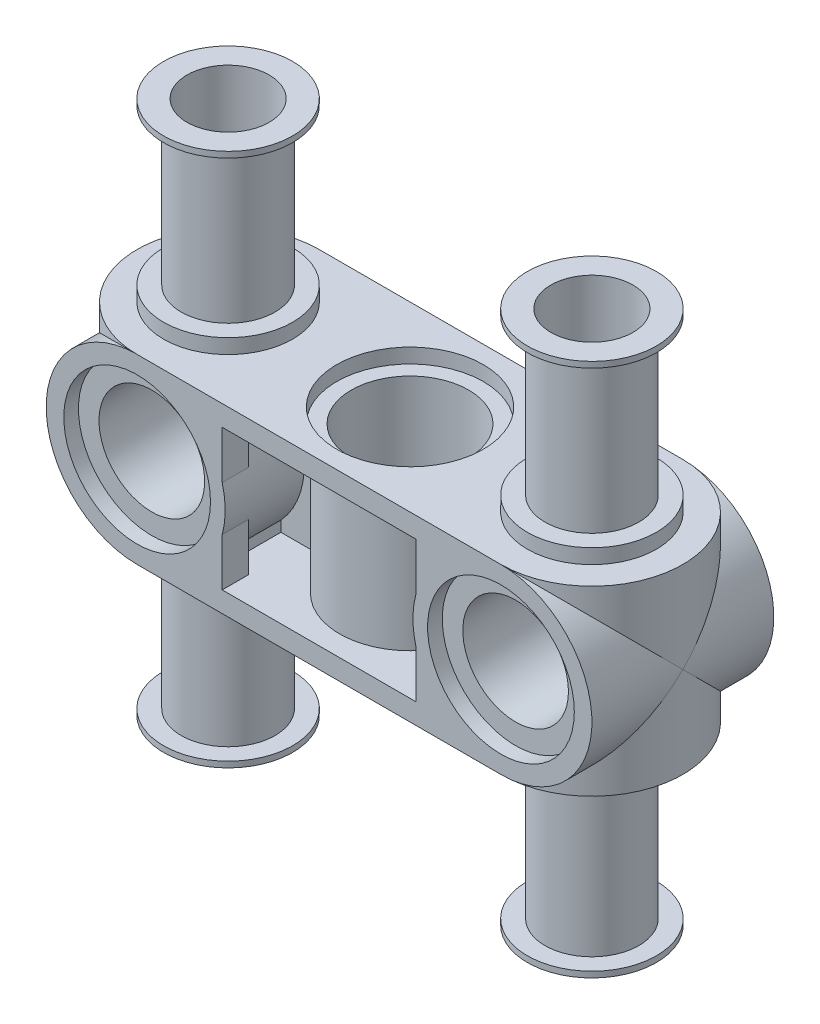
from build123d import *
from build123d.topology import SkipClean

# Parameters (mm, degrees)
EXTRUDE1_DEPTH     = 3.937
SKETCH2_R          = 2.794
CUT_EXTRUDE1_DEPTH = 0.254
SKETCH3_R          = 2.794
EXTRUDE2_DEPTH     = 0.635
SKETCH5_R          = 2.032
SKETCH5_R_2        = 1.778
EXTRUDE4_DEPTH     = 6.985
EXTRUDE5_START     = -0.254
SKETCH6_R          = 2.794
SKETCH6_R_2        = 1.778
EXTRUDE5_DEPTH     = 0.254
EXTRUDE6_DEPTH     = 7.874
SKETCH8_R          = 2.54
CUT_EXTRUDE2_DEPTH = 3.556
SKETCH9_R          = 2.286
CUT_EXTRUDE3_DEPTH = 17.110989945
SKETCH10_R         = 3.175
CUT_EXTRUDE4_DEPTH = 0.635
CUT_EXTRUDE6_DEPTH = 3.048
SKETCH13_R         = 2.54
CUT_EXTRUDE7_DEPTH = 15.799178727
SKETCH14_R         = 3.175
CUT_EXTRUDE8_DEPTH = 0.635
EXTRUDE8_DEPTH     = 7.112


with BuildPart() as part:
    # Sketch1 → Extrude1 (new body)
    with BuildSketch(Plane(origin=(0, 0, 0), x_dir=(1, 0, 0), z_dir=(0, 1, 0))):
        with BuildLine():
            Line((-7.874, 3.937), (7.874, 3.937))
            ThreePointArc((7.874, 3.937), (11.811, 0), (7.874, -3.937))
            Line((7.874, -3.937), (-7.874, -3.937))
            ThreePointArc((-7.874, -3.937), (-11.811, 0), (-7.874, 3.937))
        make_face()
    extrude(amount=EXTRUDE1_DEPTH)

    # Sketch2 → Cut-Extrude1 (cut)
    with BuildSketch(Plane.XZ):
        with Locations(Location((0, 0, 0), (0, 0, 270))):
            Circle(SKETCH2_R)
    extrude(amount=-CUT_EXTRUDE1_DEPTH, mode=Mode.SUBTRACT)

    # Sketch3 → Extrude2 (add)
    with BuildSketch(Plane.XZ):
        with Locations(Location((7.874, 0, 0), (0, 0, 90))):
            Circle(SKETCH3_R)
        with Locations(Location((-7.874, 0, 0), (0, 0, 90))):
            Circle(SKETCH3_R)
    extrude(amount=EXTRUDE2_DEPTH)

    # Sketch5 → Extrude4 (add)
    # profile 1 of 2: a face of its own
    with BuildSketch(Plane.XZ.offset(0.635)):
        with Locations(Location((7.874, 0, 0), (0, 0, 270))):
            Circle(SKETCH5_R)
        with Locations(Location((7.874, 0, 0), (0, 0, 270))):
            Circle(SKETCH5_R_2, mode=Mode.SUBTRACT)
    # profile 2 of 2: a face of its own
    with BuildSketch(Plane.XZ.offset(0.635)):
        with Locations(Location((-7.874, 0, 0), (0, 0, 270))):
            Circle(SKETCH5_R)
        with Locations(Location((-7.874, 0, 0), (0, 0, 270))):
            Circle(SKETCH5_R_2, mode=Mode.SUBTRACT)
    extrude(amount=EXTRUDE4_DEPTH)

    # Sketch6 → Extrude5 (add)
    # profile 1 of 2: a face of its own
    with BuildSketch(Plane.XZ.offset(7.62).offset(EXTRUDE5_START)):
        with Locations(Location((-7.874, 0, 0), (0, 0, 90))):
            Circle(SKETCH6_R)
        with Locations(Location((-7.874, 0, 0), (0, 0, 270))):
            Circle(SKETCH6_R_2, mode=Mode.SUBTRACT)
    # profile 2 of 2: a face of its own
    with BuildSketch(Plane.XZ.offset(7.62).offset(EXTRUDE5_START)):
        with Locations(Location((7.874, 0, 0), (0, 0, 90))):
            Circle(SKETCH6_R)
        with Locations(Location((7.874, 0, 0), (0, 0, 270))):
            Circle(SKETCH6_R_2, mode=Mode.SUBTRACT)
    extrude(amount=EXTRUDE5_DEPTH)

    # Sketch7 → Extrude6 (add)
    with BuildSketch(Plane(origin=(0, 0, -3.937), x_dir=(-1, 0, 0), z_dir=(0, 0, -1))):
        with BuildLine():
            Line((-7.874, 0), (7.874, 0))
            ThreePointArc((7.874, 0), (10.657879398, 1.153120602), (11.811, 3.937))
            Line((11.811, 3.937), (7.874, 3.937))
            Line((7.874, 3.937), (-7.874, 3.937))
            Line((-7.874, 3.937), (-11.811, 3.937))
            ThreePointArc((-11.811, 3.937), (-10.657879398, 1.153120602), (-7.874, 0))
        make_face()
    extrude(amount=-EXTRUDE6_DEPTH)

    # Sketch8 → Cut-Extrude2 (cut)
    with BuildSketch(Plane(origin=(0, 3.937, 0), x_dir=(1, 0, 0), z_dir=(0, 1, 0))):
        with Locations(Location((0, 0, 0), (0, 0, 270))):
            Circle(SKETCH8_R)
    extrude(amount=-CUT_EXTRUDE2_DEPTH, mode=Mode.SUBTRACT)

    # Sketch9 → Cut-Extrude3 (cut, through all)
    with BuildSketch(Plane.XY.offset(3.937)):
        with Locations((7.874, 3.937)):
            Circle(SKETCH9_R)
        with Locations((-7.874, 3.937)):
            Circle(SKETCH9_R)
    extrude(amount=-CUT_EXTRUDE3_DEPTH, mode=Mode.SUBTRACT)

    # Sketch10 → Cut-Extrude4 (cut)
    with BuildSketch(Plane.XY.offset(3.937)):
        with Locations((7.874, 3.937)):
            Circle(SKETCH10_R)
        with Locations((-7.874, 3.937)):
            Circle(SKETCH10_R)
    cut_extrude4 = extrude(amount=-CUT_EXTRUDE4_DEPTH, mode=Mode.SUBTRACT)

    # Mirror2: Cut-Extrude4 across plane
    add(cut_extrude4.mirror(Plane.XY), mode=Mode.SUBTRACT)

    # Sketch11 → Cut-Extrude6 (cut)
    with BuildSketch(Plane(origin=(0, 3.937, 0), x_dir=(1, 0, 0), z_dir=(0, 1, 0))):
        with BuildLine():
            Line((-5.08, -0.508), (-5.08, -2.794))
            Line((-5.08, -2.794), (-4.191, -2.794))
            Line((-4.191, -2.794), (-4.191, -3.937))
            Line((-4.191, -3.937), (4.191, -3.937))
            Line((4.191, -3.937), (4.191, -2.794))
            Line((4.191, -2.794), (5.08, -2.794))
            Line((5.08, -2.794), (5.08, -0.508))
            Line((5.08, -0.508), (3.00536853, -0.508))
            ThreePointArc((3.00536853, -0.508), (0, -3.048), (-3.00536853, -0.508))
            Line((-3.00536853, -0.508), (-5.08, -0.508))
        make_face()
        with BuildLine():
            Line((5.08, 0.508), (5.08, 2.794))
            Line((5.08, 2.794), (4.191, 2.794))
            Line((4.191, 2.794), (4.191, 3.937))
            Line((4.191, 3.937), (-4.191, 3.937))
            Line((-4.191, 3.937), (-4.191, 2.794))
            Line((-4.191, 2.794), (-5.08, 2.794))
            Line((-5.08, 2.794), (-5.08, 0.508))
            Line((-5.08, 0.508), (-3.00536853, 0.508))
            ThreePointArc((-3.00536853, 0.508), (0, 3.048), (3.00536853, 0.508))
            Line((3.00536853, 0.508), (5.08, 0.508))
        make_face()
    extrude(amount=-CUT_EXTRUDE6_DEPTH, mode=Mode.SUBTRACT)

    # Sketch13 → Cut-Extrude7 (cut, through all)
    with BuildSketch(Plane(origin=(0, 0.381, 0), x_dir=(1, 0, 0), z_dir=(0, 1, 0))):
        with Locations(Location((0, 0, 0), (0, 0, 270))):
            Circle(SKETCH13_R)
    extrude(amount=-CUT_EXTRUDE7_DEPTH, mode=Mode.SUBTRACT)

    # Sketch14 → Cut-Extrude8 (cut)
    with BuildSketch(Plane.XZ):
        with Locations(Location((0, 0, 0), (0, 0, 270))):
            Circle(SKETCH14_R)
    extrude(amount=-CUT_EXTRUDE8_DEPTH, mode=Mode.SUBTRACT)

    # Sketch17 → Extrude8 (add)
    with BuildSketch(Plane.XY.offset(3.937)):
        with BuildLine():
            Line((-4.064, 3.937), (-4.699, 3.937))
            ThreePointArc((-4.699, 3.937), (-7.874, 0.762), (-11.049, 3.937))
            Line((-11.049, 3.937), (-11.684, 3.937))
            ThreePointArc((-11.684, 3.937), (-7.874, 0.127), (-4.064, 3.937))
        make_face()
    extrude8 = extrude(amount=-EXTRUDE8_DEPTH)

    # Mirror3: Extrude8 across plane
    add(extrude8.mirror(Plane(origin=(0, 0, 0), x_dir=(0, 0, 1), z_dir=(1, 0, 0))))

    # Mirror1: part across face


with BuildPart() as part_1:
    with SkipClean():  # the faces are left unmerged after this step: merging them gives an invalid solid
        add(part.part)
        add(part.part.mirror(Plane(origin=(0, 3.937, 0.023671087), x_dir=(0, 0, 1), z_dir=(0, 1, 0))))


solid = part_1.part
